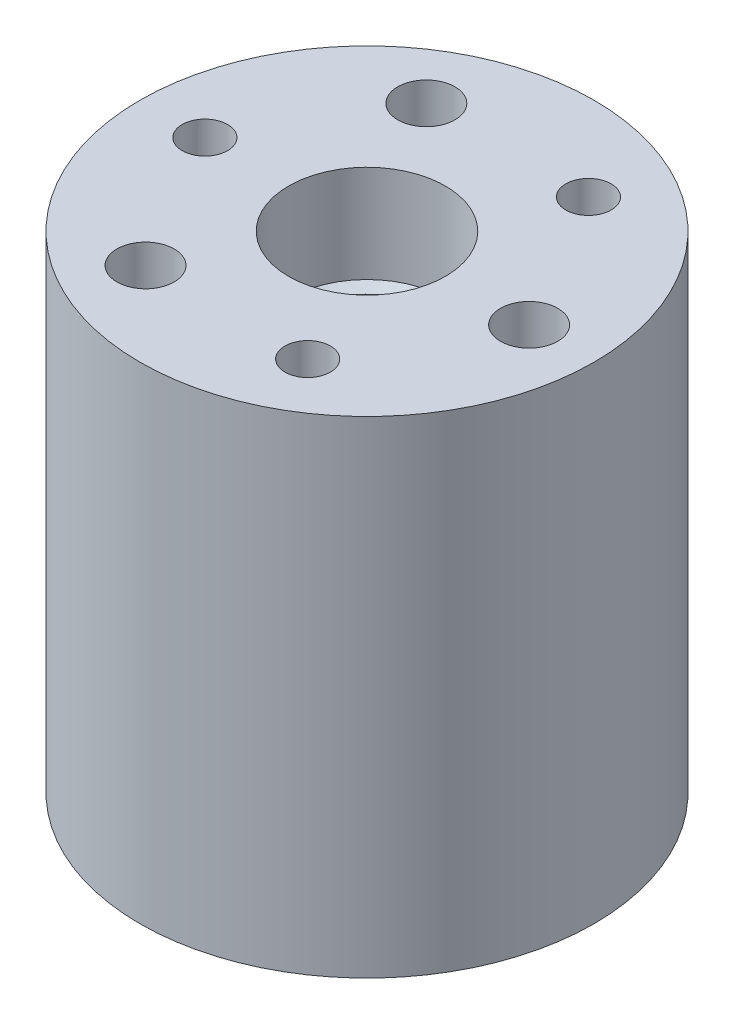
from build123d import *

# Parameters (mm, degrees)
SKETCH2_R                          = 21
BOSS_EXTRUDE1_DEPTH                = 45
F_1_8_0_125_DIAMETER_HOLE1_D       = 3.175
SKETCH10_R                         = 6.35
CUT_EXTRUDE2_DEPTH                 = 36
M16X1_5_TAPPED_HOLE1_D             = 14.5
M16X1_5_TAPPED_HOLE1_DEPTH         = 9
M16X1_5_TAPPED_HOLE1_TIP           = 4.356239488
M5_CLEARANCE_HOLE1_D               = 5.3
CIRPATTERN2_COUNT                  = 3
CIRPATTERN3_COUNT                  = 3
SKETCH17_R                         = 8
CUT_EXTRUDE3_DEPTH                 = 2
SKETCH19_W                         = 2.1336
SKETCH19_H                         = 1.3208
F_1_16_0_0625_DIAMETER_HOLE1_D     = 1.5875
F_1_16_0_0625_DIAMETER_HOLE1_DEPTH = 20
F_1_16_0_0625_DIAMETER_HOLE1_TIP   = 0.476933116
F_10_32_TAPPED_HOLE1_D             = 4.0386
F_10_32_TAPPED_HOLE1_DEPTH         = 6.2992
F_10_32_TAPPED_HOLE1_TIP           = 1.213317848
CHAMFER1_SIZE                      = 0.5


with BuildPart() as part:
    # Sketch2 → Boss-Extrude1 (new body)
    with BuildSketch(Plane(origin=(0, 0, 0), x_dir=(1, 0, 0), z_dir=(0, 1, 0))):
        with Locations(Location((0, 0, 0), (0, 0, 270))):
            Circle(SKETCH2_R)
    extrude(amount=-BOSS_EXTRUDE1_DEPTH)

    # 1_8 _0.125_ Diameter Hole1 (through all)
    with Locations(Plane(origin=(0, 0, 0), x_dir=(1, 0, 0), z_dir=(0, 1, 0))):
        with Locations((0, 0)):
            Hole(F_1_8_0_125_DIAMETER_HOLE1_D / 2)

    # Sketch10 → Cut-Extrude2 (cut)
    with BuildSketch(Plane(origin=(0, 0, 0), x_dir=(1, 0, 0), z_dir=(0, 1, 0))):
        with Locations(Location((0, 0, 0), (0, 0, 270))):
            Circle(SKETCH10_R)
    extrude(amount=-CUT_EXTRUDE2_DEPTH, mode=Mode.SUBTRACT)

    # M16x1.5 Tapped Hole1
    with Locations(Plane(origin=(0, 0, 0), x_dir=(1, 0, 0), z_dir=(0, 1, 0))):
        with Locations((0, 0)):
            Hole(M16X1_5_TAPPED_HOLE1_D / 2, depth=M16X1_5_TAPPED_HOLE1_DEPTH)
            with Locations((0, 0, -(M16X1_5_TAPPED_HOLE1_DEPTH + M16X1_5_TAPPED_HOLE1_TIP / 2))):  # 118° drill point
                Cone(0, M16X1_5_TAPPED_HOLE1_D / 2, M16X1_5_TAPPED_HOLE1_TIP, mode=Mode.SUBTRACT)

    # M5 Clearance Hole1 (through all)
    with Locations(Plane(origin=(0, 0, 0), x_dir=(1, 0, 0), z_dir=(0, 1, 0))):
        with Locations((15, 0)):
            m5_clearance_hole1 = Hole(M5_CLEARANCE_HOLE1_D / 2)

    # CirPattern2: M5 Clearance Hole1 ×3 about axis
    cirpattern2_axis = Axis((0, 0, 0), (0, 1, 0))
    for i in range(1, CIRPATTERN2_COUNT):
        add(m5_clearance_hole1.rotate(cirpattern2_axis, i * 360 / CIRPATTERN2_COUNT), mode=Mode.SUBTRACT)

    # Sketch7 → M5x0.8 Tapped Hole1 (revolve, cut)
    with BuildSketch(Plane(origin=(-15, 0, 0), x_dir=(0, 0, 1), z_dir=(1, 0, 0))):
        Polygon((0, 0), (0, 19.2618073), (2.1, 18), (2.1, 0), align=None)
    m5x0_8_tapped_hole1 = revolve(axis=Axis((-15, 6.35, 0), (0, -1, 0)), mode=Mode.SUBTRACT)

    # CirPattern3: M5x0.8 Tapped Hole1 ×3 about axis
    cirpattern3_axis = Axis((0, 0, 0), (0, 1, 0))
    for i in range(1, CIRPATTERN3_COUNT):
        add(m5x0_8_tapped_hole1.rotate(cirpattern3_axis, i * 360 / CIRPATTERN3_COUNT), mode=Mode.SUBTRACT)

    # Sketch17 → Cut-Extrude3 (cut)
    with BuildSketch(Plane.XZ.offset(45)):
        with Locations(Location((0, 0, 0), (0, 0, 270))):
            Circle(SKETCH17_R)
    extrude(amount=-CUT_EXTRUDE3_DEPTH, mode=Mode.SUBTRACT)

    # Sketch19 → Cut-Revolve1 (revolve, cut)
    with BuildSketch(Plane(origin=(0, 0, 0), x_dir=(0, 0, -1), z_dir=(1, 0, 0))):
        with Locations((-5.334, -42.3396)):
            Rectangle(SKETCH19_W, SKETCH19_H)
    revolve(axis=Axis((0, 15.13199222, 0), (0, -1, 0)), mode=Mode.SUBTRACT)

    # 1_16 _0.0625_ Diameter Hole1
    with Locations(Plane.ZY.offset(21)):
        with Locations((0, -38.5)):
            Hole(F_1_16_0_0625_DIAMETER_HOLE1_D / 2, depth=F_1_16_0_0625_DIAMETER_HOLE1_DEPTH)
            with Locations((0, 0, -(F_1_16_0_0625_DIAMETER_HOLE1_DEPTH + F_1_16_0_0625_DIAMETER_HOLE1_TIP / 2))):  # 118° drill point
                Cone(0, F_1_16_0_0625_DIAMETER_HOLE1_D / 2, F_1_16_0_0625_DIAMETER_HOLE1_TIP, mode=Mode.SUBTRACT)

    # 10-32 Tapped Hole1
    with Locations(Plane.ZY.offset(21)):
        with Locations((0, -38.5)):
            Hole(F_10_32_TAPPED_HOLE1_D / 2, depth=F_10_32_TAPPED_HOLE1_DEPTH)
            with Locations((0, 0, -(F_10_32_TAPPED_HOLE1_DEPTH + F_10_32_TAPPED_HOLE1_TIP / 2))):  # 118° drill point
                Cone(0, F_10_32_TAPPED_HOLE1_D / 2, F_10_32_TAPPED_HOLE1_TIP, mode=Mode.SUBTRACT)

    # Sketch23 → Cut-Revolve2 (revolve, cut)
    with BuildSketch(Plane.XY, mode=Mode.PRIVATE) as cut_revolve2_sk:
        Polygon((-14.65, -36.799611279), (-14.65, -38.5), (-10.586, -38.5), (-10.586, -37.6491), (-12.316048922, -37.6491), align=None)
    revolve(cut_revolve2_sk.sketch.rotate(Axis((22.89068527, -38.5, 0), (-1, 0, 0)), 270), axis=Axis((22.89068527, -38.5, 0), (-1, 0, 0)), mode=Mode.SUBTRACT)

    # Chamfer1
    chamfer1_edges = [part.edges().sort_by_distance(p)[0] for p in [
        (0, -45, 8),
    ]]
    chamfer(chamfer1_edges, length=CHAMFER1_SIZE)


solid = part.part
